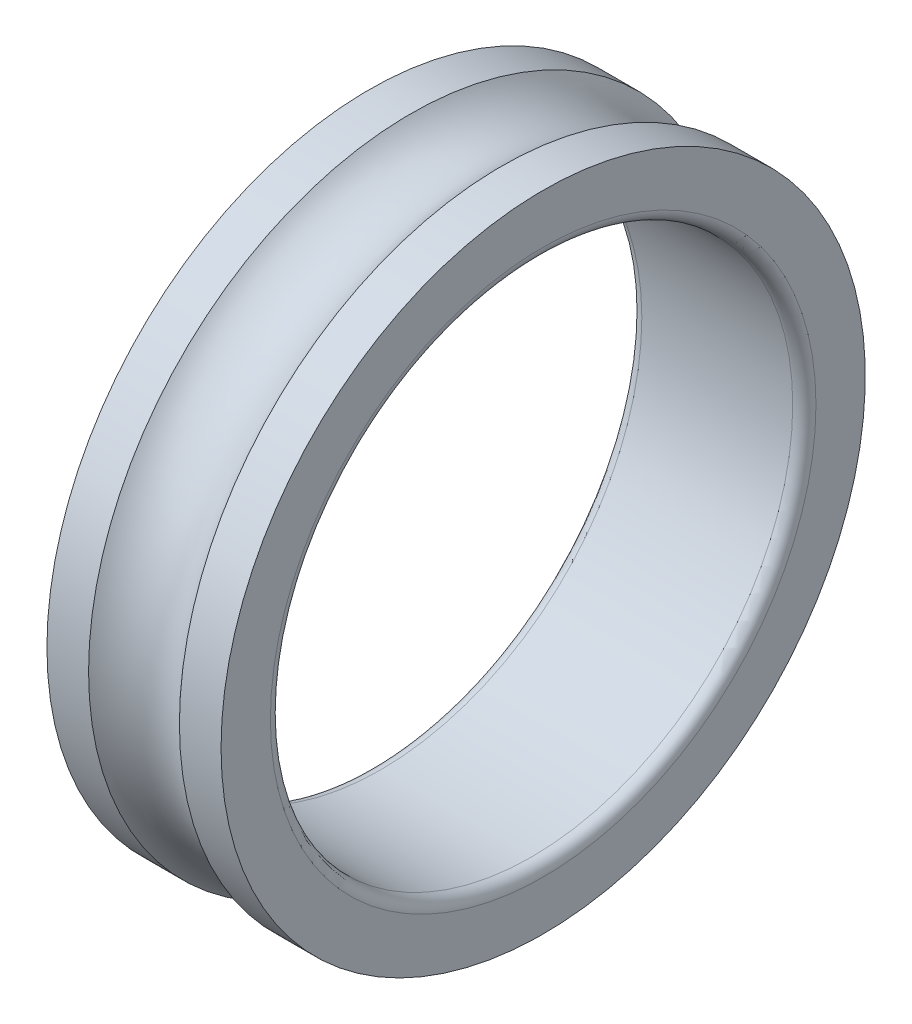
ISO-10303-21;
HEADER;
FILE_DESCRIPTION(('STEP AP214'),'2;1');
FILE_NAME('part.step','',(''),(''),'','','');
FILE_SCHEMA(('AUTOMOTIVE_DESIGN { 1 0 10303 214 1 1 1 1 }'));
ENDSEC;
DATA;
#1=APPLICATION_CONTEXT('core data for automotive mechanical design processes');
#2=APPLICATION_PROTOCOL_DEFINITION('international standard','automotive_design',2000,#1);
#3=PRODUCT_CONTEXT('',#1,'mechanical');
#4=PRODUCT('Part','Part','',(#3));
#5=PRODUCT_RELATED_PRODUCT_CATEGORY('part','',(#4));
#6=PRODUCT_DEFINITION_FORMATION('','',#4);
#7=PRODUCT_DEFINITION_CONTEXT('part definition',#1,'design');
#8=PRODUCT_DEFINITION('design','',#6,#7);
#9=PRODUCT_DEFINITION_SHAPE('','',#8);
#10=(LENGTH_UNIT() NAMED_UNIT(*) SI_UNIT(.MILLI.,.METRE.));
#11=(NAMED_UNIT(*) PLANE_ANGLE_UNIT() SI_UNIT($,.RADIAN.));
#12=(NAMED_UNIT(*) SI_UNIT($,.STERADIAN.) SOLID_ANGLE_UNIT());
#13=UNCERTAINTY_MEASURE_WITH_UNIT(LENGTH_MEASURE(1.E-05),#10,'distance_accuracy_value','');
#14=(GEOMETRIC_REPRESENTATION_CONTEXT(3) GLOBAL_UNCERTAINTY_ASSIGNED_CONTEXT((#13)) GLOBAL_UNIT_ASSIGNED_CONTEXT((#10,
#11,#12)) REPRESENTATION_CONTEXT('',''));
#15=CARTESIAN_POINT('',(0.,0.,0.));
#16=DIRECTION('',(0.,0.,1.));
#17=DIRECTION('',(1.,0.,0.));
#18=AXIS2_PLACEMENT_3D('',#15,#16,#17);
#19=CARTESIAN_POINT('',(2.,0.,0.));
#20=DIRECTION('',(-1.,0.,0.));
#21=DIRECTION('',(0.,0.,1.));
#22=AXIS2_PLACEMENT_3D('',#19,#20,#21);
#23=TOROIDAL_SURFACE('',#22,47.,2.);
#24=CARTESIAN_POINT('',(2.,0.,0.));
#25=DIRECTION('',(-1.,0.,0.));
#26=DIRECTION('',(0.,0.,1.));
#27=AXIS2_PLACEMENT_3D('',#24,#25,#26);
#28=CIRCLE('',#27,45.);
#29=CARTESIAN_POINT('',(2.,0.,45.));
#30=VERTEX_POINT('',#29);
#31=EDGE_CURVE('E10',#30,#30,#28,.T.);
#32=ORIENTED_EDGE('',*,*,#31,.F.);
#33=EDGE_LOOP('',(#32));
#34=FACE_BOUND('',#33,.T.);
#35=CARTESIAN_POINT('',(0.,0.,0.));
#36=DIRECTION('',(-1.,0.,0.));
#37=DIRECTION('',(0.,0.,1.));
#38=AXIS2_PLACEMENT_3D('',#35,#36,#37);
#39=CIRCLE('',#38,47.);
#40=CARTESIAN_POINT('',(0.,0.,47.));
#41=VERTEX_POINT('',#40);
#42=EDGE_CURVE('E57',#41,#41,#39,.T.);
#43=ORIENTED_EDGE('',*,*,#42,.T.);
#44=EDGE_LOOP('',(#43));
#45=FACE_BOUND('',#44,.T.);
#46=ADVANCED_FACE('F29',(#34,#45),#23,.T.);
#47=CARTESIAN_POINT('',(0.,0.,0.));
#48=DIRECTION('',(-1.,0.,0.));
#49=DIRECTION('',(0.,0.,1.));
#50=AXIS2_PLACEMENT_3D('',#47,#48,#49);
#51=CYLINDRICAL_SURFACE('',#50,45.);
#52=CARTESIAN_POINT('',(28.,0.,0.));
#53=DIRECTION('',(-1.,0.,0.));
#54=DIRECTION('',(0.,0.,1.));
#55=AXIS2_PLACEMENT_3D('',#52,#53,#54);
#56=CIRCLE('',#55,45.);
#57=CARTESIAN_POINT('',(28.,0.,45.));
#58=VERTEX_POINT('',#57);
#59=EDGE_CURVE('E35',#58,#58,#56,.T.);
#60=ORIENTED_EDGE('',*,*,#59,.F.);
#61=EDGE_LOOP('',(#60));
#62=FACE_BOUND('',#61,.T.);
#63=ORIENTED_EDGE('',*,*,#31,.T.);
#64=EDGE_LOOP('',(#63));
#65=FACE_BOUND('',#64,.T.);
#66=ADVANCED_FACE('F94',(#62,#65),#51,.F.);
#67=CARTESIAN_POINT('',(28.,0.,0.));
#68=DIRECTION('',(-1.,0.,0.));
#69=DIRECTION('',(0.,0.,1.));
#70=AXIS2_PLACEMENT_3D('',#67,#68,#69);
#71=TOROIDAL_SURFACE('',#70,47.,2.);
#72=CARTESIAN_POINT('',(30.,0.,0.));
#73=DIRECTION('',(-1.,0.,0.));
#74=DIRECTION('',(0.,0.,1.));
#75=AXIS2_PLACEMENT_3D('',#72,#73,#74);
#76=CIRCLE('',#75,47.);
#77=CARTESIAN_POINT('',(30.,0.,47.));
#78=VERTEX_POINT('',#77);
#79=EDGE_CURVE('E39',#78,#78,#76,.T.);
#80=ORIENTED_EDGE('',*,*,#79,.F.);
#81=EDGE_LOOP('',(#80));
#82=FACE_BOUND('',#81,.T.);
#83=ORIENTED_EDGE('',*,*,#59,.T.);
#84=EDGE_LOOP('',(#83));
#85=FACE_BOUND('',#84,.T.);
#86=ADVANCED_FACE('F89',(#82,#85),#71,.T.);
#87=CARTESIAN_POINT('',(30.,0.,-55.5));
#88=DIRECTION('',(-1.,0.,0.));
#89=DIRECTION('',(0.,0.,1.));
#90=AXIS2_PLACEMENT_3D('',#87,#88,#89);
#91=PLANE('',#90);
#92=CARTESIAN_POINT('',(30.,0.,0.));
#93=DIRECTION('',(-1.,0.,0.));
#94=DIRECTION('',(0.,0.,1.));
#95=AXIS2_PLACEMENT_3D('',#92,#93,#94);
#96=CIRCLE('',#95,55.5);
#97=CARTESIAN_POINT('',(30.,0.,55.5));
#98=VERTEX_POINT('',#97);
#99=EDGE_CURVE('E43',#98,#98,#96,.T.);
#100=ORIENTED_EDGE('',*,*,#99,.F.);
#101=EDGE_LOOP('',(#100));
#102=FACE_BOUND('',#101,.T.);
#103=ORIENTED_EDGE('',*,*,#79,.T.);
#104=EDGE_LOOP('',(#103));
#105=FACE_BOUND('',#104,.T.);
#106=ADVANCED_FACE('F83',(#102,#105),#91,.F.);
#107=CARTESIAN_POINT('',(0.,0.,0.));
#108=DIRECTION('',(-1.,0.,0.));
#109=DIRECTION('',(0.,0.,1.));
#110=AXIS2_PLACEMENT_3D('',#107,#108,#109);
#111=CYLINDRICAL_SURFACE('',#110,55.5);
#112=CARTESIAN_POINT('',(22.8262379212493,0.,0.));
#113=DIRECTION('',(-1.,0.,0.));
#114=DIRECTION('',(0.,0.,1.));
#115=AXIS2_PLACEMENT_3D('',#112,#113,#114);
#116=CIRCLE('',#115,55.5);
#117=CARTESIAN_POINT('',(22.8262379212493,0.,55.5));
#118=VERTEX_POINT('',#117);
#119=EDGE_CURVE('E48',#118,#118,#116,.T.);
#120=ORIENTED_EDGE('',*,*,#119,.F.);
#121=EDGE_LOOP('',(#120));
#122=FACE_BOUND('',#121,.T.);
#123=ORIENTED_EDGE('',*,*,#99,.T.);
#124=EDGE_LOOP('',(#123));
#125=FACE_BOUND('',#124,.T.);
#126=ADVANCED_FACE('F77',(#122,#125),#111,.T.);
#127=CARTESIAN_POINT('',(15.,0.,0.));
#128=DIRECTION('',(-1.,0.,0.));
#129=DIRECTION('',(0.,0.,1.));
#130=AXIS2_PLACEMENT_3D('',#127,#128,#129);
#131=TOROIDAL_SURFACE('',#130,62.5,10.5);
#132=CARTESIAN_POINT('',(7.17376207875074,0.,0.));
#133=DIRECTION('',(-1.,0.,0.));
#134=DIRECTION('',(0.,0.,1.));
#135=AXIS2_PLACEMENT_3D('',#132,#133,#134);
#136=CIRCLE('',#135,55.5);
#137=CARTESIAN_POINT('',(7.17376207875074,0.,55.5));
#138=VERTEX_POINT('',#137);
#139=EDGE_CURVE('E51',#138,#138,#136,.T.);
#140=ORIENTED_EDGE('',*,*,#139,.F.);
#141=EDGE_LOOP('',(#140));
#142=FACE_BOUND('',#141,.T.);
#143=ORIENTED_EDGE('',*,*,#119,.T.);
#144=EDGE_LOOP('',(#143));
#145=FACE_BOUND('',#144,.T.);
#146=ADVANCED_FACE('F71',(#142,#145),#131,.F.);
#147=CARTESIAN_POINT('',(0.,0.,0.));
#148=DIRECTION('',(-1.,0.,0.));
#149=DIRECTION('',(0.,0.,1.));
#150=AXIS2_PLACEMENT_3D('',#147,#148,#149);
#151=CYLINDRICAL_SURFACE('',#150,55.5);
#152=CARTESIAN_POINT('',(0.,0.,0.));
#153=DIRECTION('',(-1.,0.,0.));
#154=DIRECTION('',(0.,0.,1.));
#155=AXIS2_PLACEMENT_3D('',#152,#153,#154);
#156=CIRCLE('',#155,55.5);
#157=CARTESIAN_POINT('',(0.,0.,55.5));
#158=VERTEX_POINT('',#157);
#159=EDGE_CURVE('E54',#158,#158,#156,.T.);
#160=ORIENTED_EDGE('',*,*,#159,.F.);
#161=EDGE_LOOP('',(#160));
#162=FACE_BOUND('',#161,.T.);
#163=ORIENTED_EDGE('',*,*,#139,.T.);
#164=EDGE_LOOP('',(#163));
#165=FACE_BOUND('',#164,.T.);
#166=ADVANCED_FACE('F65',(#162,#165),#151,.T.);
#167=CARTESIAN_POINT('',(0.,0.,-55.5));
#168=DIRECTION('',(1.,0.,0.));
#169=DIRECTION('',(0.,0.,-1.));
#170=AXIS2_PLACEMENT_3D('',#167,#168,#169);
#171=PLANE('',#170);
#172=ORIENTED_EDGE('',*,*,#42,.F.);
#173=EDGE_LOOP('',(#172));
#174=FACE_BOUND('',#173,.T.);
#175=ORIENTED_EDGE('',*,*,#159,.T.);
#176=EDGE_LOOP('',(#175));
#177=FACE_BOUND('',#176,.T.);
#178=ADVANCED_FACE('F62',(#174,#177),#171,.F.);
#179=CLOSED_SHELL('',(#46,#66,#86,#106,#126,#146,#166,#178));
#180=MANIFOLD_SOLID_BREP('B2',#179);
#181=ADVANCED_BREP_SHAPE_REPRESENTATION('',(#18,#180),#14);
#182=SHAPE_DEFINITION_REPRESENTATION(#9,#181);
ENDSEC;
END-ISO-10303-21;
